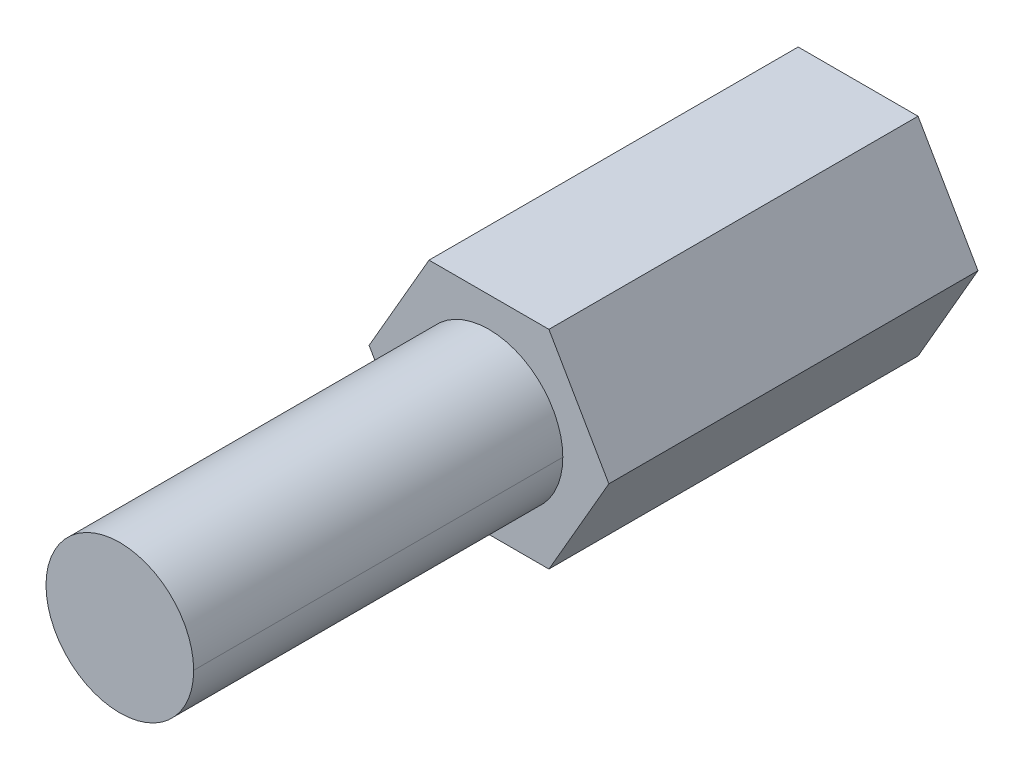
ISO-10303-21;
HEADER;
FILE_DESCRIPTION(('STEP AP214'),'2;1');
FILE_NAME('part.step','',(''),(''),'','','');
FILE_SCHEMA(('AUTOMOTIVE_DESIGN { 1 0 10303 214 1 1 1 1 }'));
ENDSEC;
DATA;
#1=APPLICATION_CONTEXT('core data for automotive mechanical design processes');
#2=APPLICATION_PROTOCOL_DEFINITION('international standard','automotive_design',2000,#1);
#3=PRODUCT_CONTEXT('',#1,'mechanical');
#4=PRODUCT('Part','Part','',(#3));
#5=PRODUCT_RELATED_PRODUCT_CATEGORY('part','',(#4));
#6=PRODUCT_DEFINITION_FORMATION('','',#4);
#7=PRODUCT_DEFINITION_CONTEXT('part definition',#1,'design');
#8=PRODUCT_DEFINITION('design','',#6,#7);
#9=PRODUCT_DEFINITION_SHAPE('','',#8);
#10=(LENGTH_UNIT() NAMED_UNIT(*) SI_UNIT(.MILLI.,.METRE.));
#11=(NAMED_UNIT(*) PLANE_ANGLE_UNIT() SI_UNIT($,.RADIAN.));
#12=(NAMED_UNIT(*) SI_UNIT($,.STERADIAN.) SOLID_ANGLE_UNIT());
#13=UNCERTAINTY_MEASURE_WITH_UNIT(LENGTH_MEASURE(1.E-05),#10,'distance_accuracy_value','');
#14=(GEOMETRIC_REPRESENTATION_CONTEXT(3) GLOBAL_UNCERTAINTY_ASSIGNED_CONTEXT((#13)) GLOBAL_UNIT_ASSIGNED_CONTEXT((#10,
#11,#12)) REPRESENTATION_CONTEXT('',''));
#15=CARTESIAN_POINT('',(0.,0.,0.));
#16=DIRECTION('',(0.,0.,1.));
#17=DIRECTION('',(1.,0.,0.));
#18=AXIS2_PLACEMENT_3D('',#15,#16,#17);
#19=CARTESIAN_POINT('',(0.,0.,16.));
#20=DIRECTION('',(0.,0.,1.));
#21=DIRECTION('',(1.,0.,0.));
#22=AXIS2_PLACEMENT_3D('',#19,#20,#21);
#23=PLANE('',#22);
#24=CARTESIAN_POINT('',(0.,0.,16.));
#25=DIRECTION('',(0.,0.,1.));
#26=DIRECTION('',(1.,0.,0.));
#27=AXIS2_PLACEMENT_3D('',#24,#25,#26);
#28=CIRCLE('',#27,1.6);
#29=CARTESIAN_POINT('',(1.6,0.,16.));
#30=VERTEX_POINT('',#29);
#31=CARTESIAN_POINT('',(-1.6,0.,16.));
#32=VERTEX_POINT('',#31);
#33=EDGE_CURVE('E11',#30,#32,#28,.T.);
#34=ORIENTED_EDGE('',*,*,#33,.T.);
#35=CARTESIAN_POINT('',(0.,0.,16.));
#36=DIRECTION('',(0.,0.,1.));
#37=DIRECTION('',(-1.,0.,0.));
#38=AXIS2_PLACEMENT_3D('',#35,#36,#37);
#39=CIRCLE('',#38,1.6);
#40=EDGE_CURVE('E119',#32,#30,#39,.T.);
#41=ORIENTED_EDGE('',*,*,#40,.T.);
#42=EDGE_LOOP('',(#34,#41));
#43=FACE_BOUND('',#42,.T.);
#44=ADVANCED_FACE('F17',(#43),#23,.T.);
#45=CARTESIAN_POINT('',(0.,0.,6.));
#46=DIRECTION('',(0.,0.,1.));
#47=DIRECTION('',(-1.,0.,0.));
#48=AXIS2_PLACEMENT_3D('',#45,#46,#47);
#49=CYLINDRICAL_SURFACE('',#48,1.6);
#50=DIRECTION('',(0.,0.,1.));
#51=VECTOR('',#50,1.);
#52=CARTESIAN_POINT('',(-1.6,0.,8.));
#53=LINE('',#52,#51);
#54=CARTESIAN_POINT('',(-1.6,0.,8.));
#55=VERTEX_POINT('',#54);
#56=EDGE_CURVE('E26',#55,#32,#53,.T.);
#57=ORIENTED_EDGE('',*,*,#56,.T.);
#58=ORIENTED_EDGE('',*,*,#33,.F.);
#59=DIRECTION('',(0.,0.,1.));
#60=VECTOR('',#59,1.);
#61=CARTESIAN_POINT('',(1.6,0.,8.));
#62=LINE('',#61,#60);
#63=CARTESIAN_POINT('',(1.6,0.,8.));
#64=VERTEX_POINT('',#63);
#65=EDGE_CURVE('E111',#64,#30,#62,.T.);
#66=ORIENTED_EDGE('',*,*,#65,.F.);
#67=CARTESIAN_POINT('',(0.,0.,8.));
#68=DIRECTION('',(0.,0.,1.));
#69=DIRECTION('',(1.,0.,0.));
#70=AXIS2_PLACEMENT_3D('',#67,#68,#69);
#71=CIRCLE('',#70,1.6);
#72=EDGE_CURVE('E115',#64,#55,#71,.T.);
#73=ORIENTED_EDGE('',*,*,#72,.T.);
#74=EDGE_LOOP('',(#57,#58,#66,#73));
#75=FACE_BOUND('',#74,.T.);
#76=ADVANCED_FACE('F113',(#75),#49,.T.);
#77=CARTESIAN_POINT('',(0.,0.,6.));
#78=DIRECTION('',(0.,0.,1.));
#79=DIRECTION('',(-1.,0.,0.));
#80=AXIS2_PLACEMENT_3D('',#77,#78,#79);
#81=CYLINDRICAL_SURFACE('',#80,1.6);
#82=ORIENTED_EDGE('',*,*,#65,.T.);
#83=ORIENTED_EDGE('',*,*,#40,.F.);
#84=ORIENTED_EDGE('',*,*,#56,.F.);
#85=CARTESIAN_POINT('',(0.,0.,8.));
#86=DIRECTION('',(0.,0.,1.));
#87=DIRECTION('',(-1.,0.,0.));
#88=AXIS2_PLACEMENT_3D('',#85,#86,#87);
#89=CIRCLE('',#88,1.6);
#90=EDGE_CURVE('E120',#55,#64,#89,.T.);
#91=ORIENTED_EDGE('',*,*,#90,.T.);
#92=EDGE_LOOP('',(#82,#83,#84,#91));
#93=FACE_BOUND('',#92,.T.);
#94=ADVANCED_FACE('F123',(#93),#81,.T.);
#95=CARTESIAN_POINT('',(0.,0.,8.));
#96=DIRECTION('',(0.,0.,1.));
#97=DIRECTION('',(1.,0.,0.));
#98=AXIS2_PLACEMENT_3D('',#95,#96,#97);
#99=PLANE('',#98);
#100=ORIENTED_EDGE('',*,*,#72,.F.);
#101=ORIENTED_EDGE('',*,*,#90,.F.);
#102=EDGE_LOOP('',(#100,#101));
#103=FACE_BOUND('',#102,.T.);
#104=DIRECTION('',(0.500000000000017,0.866025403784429,0.));
#105=VECTOR('',#104,1.);
#106=CARTESIAN_POINT('',(1.299038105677,-2.25,8.));
#107=LINE('',#106,#105);
#108=CARTESIAN_POINT('',(1.299038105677,-2.25,8.));
#109=VERTEX_POINT('',#108);
#110=CARTESIAN_POINT('',(2.598076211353,0.,8.));
#111=VERTEX_POINT('',#110);
#112=EDGE_CURVE('E130',#109,#111,#107,.T.);
#113=ORIENTED_EDGE('',*,*,#112,.T.);
#114=DIRECTION('',(-0.500000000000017,0.866025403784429,0.));
#115=VECTOR('',#114,1.);
#116=CARTESIAN_POINT('',(2.598076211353,0.,8.));
#117=LINE('',#116,#115);
#118=CARTESIAN_POINT('',(1.299038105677,2.25,8.));
#119=VERTEX_POINT('',#118);
#120=EDGE_CURVE('E204',#111,#119,#117,.T.);
#121=ORIENTED_EDGE('',*,*,#120,.T.);
#122=DIRECTION('',(-1.,0.,0.));
#123=VECTOR('',#122,1.);
#124=CARTESIAN_POINT('',(1.299038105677,2.25,8.));
#125=LINE('',#124,#123);
#126=CARTESIAN_POINT('',(-1.299038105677,2.25,8.));
#127=VERTEX_POINT('',#126);
#128=EDGE_CURVE('E194',#119,#127,#125,.T.);
#129=ORIENTED_EDGE('',*,*,#128,.T.);
#130=DIRECTION('',(-0.500000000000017,-0.866025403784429,0.));
#131=VECTOR('',#130,1.);
#132=CARTESIAN_POINT('',(-1.299038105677,2.25,8.));
#133=LINE('',#132,#131);
#134=CARTESIAN_POINT('',(-2.598076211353,0.,8.));
#135=VERTEX_POINT('',#134);
#136=EDGE_CURVE('E173',#127,#135,#133,.T.);
#137=ORIENTED_EDGE('',*,*,#136,.T.);
#138=DIRECTION('',(0.500000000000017,-0.866025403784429,0.));
#139=VECTOR('',#138,1.);
#140=CARTESIAN_POINT('',(-2.598076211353,0.,8.));
#141=LINE('',#140,#139);
#142=CARTESIAN_POINT('',(-1.299038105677,-2.25,8.));
#143=VERTEX_POINT('',#142);
#144=EDGE_CURVE('E158',#135,#143,#141,.T.);
#145=ORIENTED_EDGE('',*,*,#144,.T.);
#146=DIRECTION('',(1.,0.,0.));
#147=VECTOR('',#146,1.);
#148=CARTESIAN_POINT('',(-1.299038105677,-2.25,8.));
#149=LINE('',#148,#147);
#150=EDGE_CURVE('E156',#143,#109,#149,.T.);
#151=ORIENTED_EDGE('',*,*,#150,.T.);
#152=EDGE_LOOP('',(#113,#121,#129,#137,#145,#151));
#153=FACE_BOUND('',#152,.T.);
#154=ADVANCED_FACE('F127',(#103,#153),#99,.T.);
#155=CARTESIAN_POINT('',(1.299038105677,-2.25,0.));
#156=DIRECTION('',(0.866025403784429,-0.500000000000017,0.));
#157=DIRECTION('',(0.,0.,-1.));
#158=AXIS2_PLACEMENT_3D('',#155,#156,#157);
#159=PLANE('',#158);
#160=DIRECTION('',(0.,0.,1.));
#161=VECTOR('',#160,1.);
#162=CARTESIAN_POINT('',(2.598076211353,0.,0.));
#163=LINE('',#162,#161);
#164=CARTESIAN_POINT('',(2.598076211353,0.,0.));
#165=VERTEX_POINT('',#164);
#166=EDGE_CURVE('E136',#165,#111,#163,.T.);
#167=ORIENTED_EDGE('',*,*,#166,.T.);
#168=ORIENTED_EDGE('',*,*,#112,.F.);
#169=DIRECTION('',(0.,0.,1.));
#170=VECTOR('',#169,1.);
#171=CARTESIAN_POINT('',(1.299038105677,-2.25,0.));
#172=LINE('',#171,#170);
#173=CARTESIAN_POINT('',(1.299038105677,-2.25,0.));
#174=VERTEX_POINT('',#173);
#175=EDGE_CURVE('E152',#174,#109,#172,.T.);
#176=ORIENTED_EDGE('',*,*,#175,.F.);
#177=DIRECTION('',(0.500000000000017,0.866025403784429,0.));
#178=VECTOR('',#177,1.);
#179=CARTESIAN_POINT('',(1.299038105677,-2.25,0.));
#180=LINE('',#179,#178);
#181=EDGE_CURVE('E169',#174,#165,#180,.T.);
#182=ORIENTED_EDGE('',*,*,#181,.T.);
#183=EDGE_LOOP('',(#167,#168,#176,#182));
#184=FACE_BOUND('',#183,.T.);
#185=ADVANCED_FACE('F247',(#184),#159,.T.);
#186=CARTESIAN_POINT('',(2.598076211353,0.,0.));
#187=DIRECTION('',(0.866025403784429,0.500000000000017,0.));
#188=DIRECTION('',(0.,0.,-1.));
#189=AXIS2_PLACEMENT_3D('',#186,#187,#188);
#190=PLANE('',#189);
#191=DIRECTION('',(0.,0.,1.));
#192=VECTOR('',#191,1.);
#193=CARTESIAN_POINT('',(1.299038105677,2.25,0.));
#194=LINE('',#193,#192);
#195=CARTESIAN_POINT('',(1.299038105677,2.25,0.));
#196=VERTEX_POINT('',#195);
#197=EDGE_CURVE('E201',#196,#119,#194,.T.);
#198=ORIENTED_EDGE('',*,*,#197,.T.);
#199=ORIENTED_EDGE('',*,*,#120,.F.);
#200=ORIENTED_EDGE('',*,*,#166,.F.);
#201=DIRECTION('',(-0.500000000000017,0.866025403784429,0.));
#202=VECTOR('',#201,1.);
#203=CARTESIAN_POINT('',(2.598076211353,0.,0.));
#204=LINE('',#203,#202);
#205=EDGE_CURVE('E165',#165,#196,#204,.T.);
#206=ORIENTED_EDGE('',*,*,#205,.T.);
#207=EDGE_LOOP('',(#198,#199,#200,#206));
#208=FACE_BOUND('',#207,.T.);
#209=ADVANCED_FACE('F227',(#208),#190,.T.);
#210=CARTESIAN_POINT('',(1.299038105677,2.25,0.));
#211=DIRECTION('',(0.,1.,0.));
#212=DIRECTION('',(1.,0.,0.));
#213=AXIS2_PLACEMENT_3D('',#210,#211,#212);
#214=PLANE('',#213);
#215=DIRECTION('',(0.,0.,1.));
#216=VECTOR('',#215,1.);
#217=CARTESIAN_POINT('',(-1.299038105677,2.25,0.));
#218=LINE('',#217,#216);
#219=CARTESIAN_POINT('',(-1.299038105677,2.25,0.));
#220=VERTEX_POINT('',#219);
#221=EDGE_CURVE('E190',#220,#127,#218,.T.);
#222=ORIENTED_EDGE('',*,*,#221,.T.);
#223=ORIENTED_EDGE('',*,*,#128,.F.);
#224=ORIENTED_EDGE('',*,*,#197,.F.);
#225=DIRECTION('',(-1.,0.,0.));
#226=VECTOR('',#225,1.);
#227=CARTESIAN_POINT('',(1.299038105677,2.25,0.));
#228=LINE('',#227,#226);
#229=EDGE_CURVE('E144',#196,#220,#228,.T.);
#230=ORIENTED_EDGE('',*,*,#229,.T.);
#231=EDGE_LOOP('',(#222,#223,#224,#230));
#232=FACE_BOUND('',#231,.T.);
#233=ADVANCED_FACE('F231',(#232),#214,.T.);
#234=CARTESIAN_POINT('',(-1.299038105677,2.25,0.));
#235=DIRECTION('',(-0.866025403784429,0.500000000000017,0.));
#236=DIRECTION('',(0.,0.,1.));
#237=AXIS2_PLACEMENT_3D('',#234,#235,#236);
#238=PLANE('',#237);
#239=DIRECTION('',(0.,0.,1.));
#240=VECTOR('',#239,1.);
#241=CARTESIAN_POINT('',(-2.598076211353,0.,0.));
#242=LINE('',#241,#240);
#243=CARTESIAN_POINT('',(-2.598076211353,0.,0.));
#244=VERTEX_POINT('',#243);
#245=EDGE_CURVE('E160',#244,#135,#242,.T.);
#246=ORIENTED_EDGE('',*,*,#245,.T.);
#247=ORIENTED_EDGE('',*,*,#136,.F.);
#248=ORIENTED_EDGE('',*,*,#221,.F.);
#249=DIRECTION('',(-0.500000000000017,-0.866025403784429,0.));
#250=VECTOR('',#249,1.);
#251=CARTESIAN_POINT('',(-1.299038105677,2.25,0.));
#252=LINE('',#251,#250);
#253=EDGE_CURVE('E142',#220,#244,#252,.T.);
#254=ORIENTED_EDGE('',*,*,#253,.T.);
#255=EDGE_LOOP('',(#246,#247,#248,#254));
#256=FACE_BOUND('',#255,.T.);
#257=ADVANCED_FACE('F235',(#256),#238,.T.);
#258=CARTESIAN_POINT('',(-2.598076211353,0.,0.));
#259=DIRECTION('',(-0.866025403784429,-0.500000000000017,0.));
#260=DIRECTION('',(-0.500000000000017,0.866025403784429,0.));
#261=AXIS2_PLACEMENT_3D('',#258,#259,#260);
#262=PLANE('',#261);
#263=DIRECTION('',(0.,0.,1.));
#264=VECTOR('',#263,1.);
#265=CARTESIAN_POINT('',(-1.299038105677,-2.25,0.));
#266=LINE('',#265,#264);
#267=CARTESIAN_POINT('',(-1.299038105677,-2.25,0.));
#268=VERTEX_POINT('',#267);
#269=EDGE_CURVE('E161',#268,#143,#266,.T.);
#270=ORIENTED_EDGE('',*,*,#269,.T.);
#271=ORIENTED_EDGE('',*,*,#144,.F.);
#272=ORIENTED_EDGE('',*,*,#245,.F.);
#273=DIRECTION('',(0.500000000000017,-0.866025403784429,0.));
#274=VECTOR('',#273,1.);
#275=CARTESIAN_POINT('',(-2.598076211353,0.,0.));
#276=LINE('',#275,#274);
#277=EDGE_CURVE('E140',#244,#268,#276,.T.);
#278=ORIENTED_EDGE('',*,*,#277,.T.);
#279=EDGE_LOOP('',(#270,#271,#272,#278));
#280=FACE_BOUND('',#279,.T.);
#281=ADVANCED_FACE('F240',(#280),#262,.T.);
#282=CARTESIAN_POINT('',(-1.299038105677,-2.25,0.));
#283=DIRECTION('',(0.,-1.,0.));
#284=DIRECTION('',(0.,0.,-1.));
#285=AXIS2_PLACEMENT_3D('',#282,#283,#284);
#286=PLANE('',#285);
#287=ORIENTED_EDGE('',*,*,#175,.T.);
#288=ORIENTED_EDGE('',*,*,#150,.F.);
#289=ORIENTED_EDGE('',*,*,#269,.F.);
#290=DIRECTION('',(1.,0.,0.));
#291=VECTOR('',#290,1.);
#292=CARTESIAN_POINT('',(-1.299038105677,-2.25,0.));
#293=LINE('',#292,#291);
#294=EDGE_CURVE('E177',#268,#174,#293,.T.);
#295=ORIENTED_EDGE('',*,*,#294,.T.);
#296=EDGE_LOOP('',(#287,#288,#289,#295));
#297=FACE_BOUND('',#296,.T.);
#298=ADVANCED_FACE('F244',(#297),#286,.T.);
#299=CARTESIAN_POINT('',(0.,0.,0.));
#300=DIRECTION('',(0.,0.,1.));
#301=DIRECTION('',(1.,0.,0.));
#302=AXIS2_PLACEMENT_3D('',#299,#300,#301);
#303=CYLINDRICAL_SURFACE('',#302,1.5);
#304=DIRECTION('',(0.,0.,1.));
#305=VECTOR('',#304,1.);
#306=CARTESIAN_POINT('',(-1.5,0.,0.));
#307=LINE('',#306,#305);
#308=CARTESIAN_POINT('',(-1.5,0.,0.));
#309=VERTEX_POINT('',#308);
#310=CARTESIAN_POINT('',(-1.5,0.,6.));
#311=VERTEX_POINT('',#310);
#312=EDGE_CURVE('E181',#309,#311,#307,.T.);
#313=ORIENTED_EDGE('',*,*,#312,.F.);
#314=CARTESIAN_POINT('',(0.,0.,0.));
#315=DIRECTION('',(0.,0.,-1.));
#316=DIRECTION('',(-1.,0.,0.));
#317=AXIS2_PLACEMENT_3D('',#314,#315,#316);
#318=CIRCLE('',#317,1.5);
#319=CARTESIAN_POINT('',(1.5,0.,0.));
#320=VERTEX_POINT('',#319);
#321=EDGE_CURVE('E151',#309,#320,#318,.T.);
#322=ORIENTED_EDGE('',*,*,#321,.T.);
#323=DIRECTION('',(0.,0.,1.));
#324=VECTOR('',#323,1.);
#325=CARTESIAN_POINT('',(1.5,0.,0.));
#326=LINE('',#325,#324);
#327=CARTESIAN_POINT('',(1.5,0.,6.));
#328=VERTEX_POINT('',#327);
#329=EDGE_CURVE('E150',#320,#328,#326,.T.);
#330=ORIENTED_EDGE('',*,*,#329,.T.);
#331=CARTESIAN_POINT('',(0.,0.,6.));
#332=DIRECTION('',(0.,0.,1.));
#333=DIRECTION('',(1.,0.,0.));
#334=AXIS2_PLACEMENT_3D('',#331,#332,#333);
#335=CIRCLE('',#334,1.5);
#336=EDGE_CURVE('E157',#328,#311,#335,.T.);
#337=ORIENTED_EDGE('',*,*,#336,.T.);
#338=EDGE_LOOP('',(#313,#322,#330,#337));
#339=FACE_BOUND('',#338,.T.);
#340=ADVANCED_FACE('F307',(#339),#303,.F.);
#341=CARTESIAN_POINT('',(0.,0.,6.));
#342=DIRECTION('',(0.,0.,1.));
#343=DIRECTION('',(1.,0.,0.));
#344=AXIS2_PLACEMENT_3D('',#341,#342,#343);
#345=PLANE('',#344);
#346=ORIENTED_EDGE('',*,*,#336,.F.);
#347=CARTESIAN_POINT('',(0.,0.,6.));
#348=DIRECTION('',(0.,0.,1.));
#349=DIRECTION('',(-1.,0.,0.));
#350=AXIS2_PLACEMENT_3D('',#347,#348,#349);
#351=CIRCLE('',#350,1.5);
#352=EDGE_CURVE('E197',#311,#328,#351,.T.);
#353=ORIENTED_EDGE('',*,*,#352,.F.);
#354=EDGE_LOOP('',(#346,#353));
#355=FACE_BOUND('',#354,.T.);
#356=ADVANCED_FACE('F309',(#355),#345,.F.);
#357=CARTESIAN_POINT('',(0.,0.,0.));
#358=DIRECTION('',(0.,0.,1.));
#359=DIRECTION('',(1.,0.,0.));
#360=AXIS2_PLACEMENT_3D('',#357,#358,#359);
#361=CYLINDRICAL_SURFACE('',#360,1.5);
#362=ORIENTED_EDGE('',*,*,#329,.F.);
#363=CARTESIAN_POINT('',(0.,0.,0.));
#364=DIRECTION('',(0.,0.,-1.));
#365=DIRECTION('',(1.,0.,0.));
#366=AXIS2_PLACEMENT_3D('',#363,#364,#365);
#367=CIRCLE('',#366,1.5);
#368=EDGE_CURVE('E146',#320,#309,#367,.T.);
#369=ORIENTED_EDGE('',*,*,#368,.T.);
#370=ORIENTED_EDGE('',*,*,#312,.T.);
#371=ORIENTED_EDGE('',*,*,#352,.T.);
#372=EDGE_LOOP('',(#362,#369,#370,#371));
#373=FACE_BOUND('',#372,.T.);
#374=ADVANCED_FACE('F302',(#373),#361,.F.);
#375=CARTESIAN_POINT('',(0.,0.,0.));
#376=DIRECTION('',(0.,0.,1.));
#377=DIRECTION('',(1.,0.,0.));
#378=AXIS2_PLACEMENT_3D('',#375,#376,#377);
#379=PLANE('',#378);
#380=ORIENTED_EDGE('',*,*,#321,.F.);
#381=ORIENTED_EDGE('',*,*,#368,.F.);
#382=EDGE_LOOP('',(#380,#381));
#383=FACE_BOUND('',#382,.T.);
#384=ORIENTED_EDGE('',*,*,#277,.F.);
#385=ORIENTED_EDGE('',*,*,#253,.F.);
#386=ORIENTED_EDGE('',*,*,#229,.F.);
#387=ORIENTED_EDGE('',*,*,#205,.F.);
#388=ORIENTED_EDGE('',*,*,#181,.F.);
#389=ORIENTED_EDGE('',*,*,#294,.F.);
#390=EDGE_LOOP('',(#384,#385,#386,#387,#388,#389));
#391=FACE_BOUND('',#390,.T.);
#392=ADVANCED_FACE('F296',(#383,#391),#379,.F.);
#393=CLOSED_SHELL('',(#44,#76,#94,#154,#185,#209,#233,#257,#281,#298,#340,#356,#374,#392));
#394=MANIFOLD_SOLID_BREP('B1',#393);
#395=ADVANCED_BREP_SHAPE_REPRESENTATION('',(#18,#394),#14);
#396=SHAPE_DEFINITION_REPRESENTATION(#9,#395);
ENDSEC;
END-ISO-10303-21;
